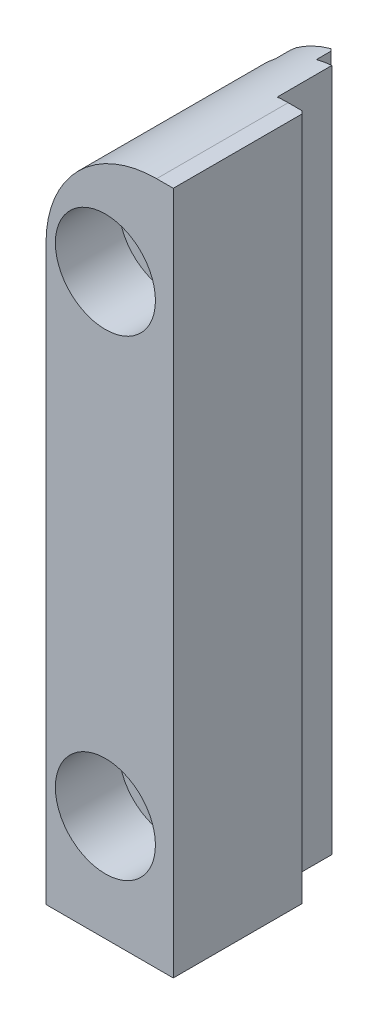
ISO-10303-21;
HEADER;
FILE_DESCRIPTION(('STEP AP214'),'2;1');
FILE_NAME('part.step','',(''),(''),'','','');
FILE_SCHEMA(('AUTOMOTIVE_DESIGN { 1 0 10303 214 1 1 1 1 }'));
ENDSEC;
DATA;
#1=APPLICATION_CONTEXT('core data for automotive mechanical design processes');
#2=APPLICATION_PROTOCOL_DEFINITION('international standard','automotive_design',2000,#1);
#3=PRODUCT_CONTEXT('',#1,'mechanical');
#4=PRODUCT('Part','Part','',(#3));
#5=PRODUCT_RELATED_PRODUCT_CATEGORY('part','',(#4));
#6=PRODUCT_DEFINITION_FORMATION('','',#4);
#7=PRODUCT_DEFINITION_CONTEXT('part definition',#1,'design');
#8=PRODUCT_DEFINITION('design','',#6,#7);
#9=PRODUCT_DEFINITION_SHAPE('','',#8);
#10=(LENGTH_UNIT() NAMED_UNIT(*) SI_UNIT(.MILLI.,.METRE.));
#11=(NAMED_UNIT(*) PLANE_ANGLE_UNIT() SI_UNIT($,.RADIAN.));
#12=(NAMED_UNIT(*) SI_UNIT($,.STERADIAN.) SOLID_ANGLE_UNIT());
#13=UNCERTAINTY_MEASURE_WITH_UNIT(LENGTH_MEASURE(1.E-05),#10,'distance_accuracy_value','');
#14=(GEOMETRIC_REPRESENTATION_CONTEXT(3) GLOBAL_UNCERTAINTY_ASSIGNED_CONTEXT((#13)) GLOBAL_UNIT_ASSIGNED_CONTEXT((#10,
#11,#12)) REPRESENTATION_CONTEXT('',''));
#15=CARTESIAN_POINT('',(0.,0.,0.));
#16=DIRECTION('',(0.,0.,1.));
#17=DIRECTION('',(1.,0.,0.));
#18=AXIS2_PLACEMENT_3D('',#15,#16,#17);
#19=CARTESIAN_POINT('',(-7.32028,29.845,-16.256));
#20=DIRECTION('',(0.,0.,-1.));
#21=DIRECTION('',(1.,0.,0.));
#22=AXIS2_PLACEMENT_3D('',#19,#20,#21);
#23=PLANE('',#22);
#24=CARTESIAN_POINT('',(-5.92328,-20.574,-16.256));
#25=DIRECTION('',(0.,0.,-1.));
#26=DIRECTION('',(-1.,0.,0.));
#27=AXIS2_PLACEMENT_3D('',#24,#25,#26);
#28=CIRCLE('',#27,2.7051);
#29=CARTESIAN_POINT('',(-8.62838,-20.574,-16.256));
#30=VERTEX_POINT('',#29);
#31=EDGE_CURVE('E342',#30,#30,#28,.T.);
#32=ORIENTED_EDGE('',*,*,#31,.F.);
#33=EDGE_LOOP('',(#32));
#34=FACE_BOUND('',#33,.T.);
#35=CARTESIAN_POINT('',(-5.92328,20.574,-16.256));
#36=DIRECTION('',(0.,0.,-1.));
#37=DIRECTION('',(-1.,0.,0.));
#38=AXIS2_PLACEMENT_3D('',#35,#36,#37);
#39=CIRCLE('',#38,2.7051);
#40=CARTESIAN_POINT('',(-8.62838,20.574,-16.256));
#41=VERTEX_POINT('',#40);
#42=EDGE_CURVE('E345',#41,#41,#39,.T.);
#43=ORIENTED_EDGE('',*,*,#42,.F.);
#44=EDGE_LOOP('',(#43));
#45=FACE_BOUND('',#44,.T.);
#46=DIRECTION('',(-0.999999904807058,0.000436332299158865,0.));
#47=VECTOR('',#46,1.);
#48=CARTESIAN_POINT('',(-7.34227917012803,-20.5733808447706,-16.256));
#49=LINE('',#48,#47);
#50=CARTESIAN_POINT('',(-2.74802630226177,-20.5753854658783,-16.256));
#51=VERTEX_POINT('',#50);
#52=CARTESIAN_POINT('',(-2.74828030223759,-20.5753853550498,-16.256));
#53=VERTEX_POINT('',#52);
#54=EDGE_CURVE('E10',#51,#53,#49,.T.);
#55=ORIENTED_EDGE('',*,*,#54,.T.);
#56=CARTESIAN_POINT('',(-5.92328,-20.574,-16.256));
#57=DIRECTION('',(0.,0.,1.));
#58=DIRECTION('',(1.,0.,0.));
#59=AXIS2_PLACEMENT_3D('',#56,#57,#58);
#60=CIRCLE('',#59,3.175);
#61=CARTESIAN_POINT('',(-2.74828,-20.574,-16.256));
#62=VERTEX_POINT('',#61);
#63=EDGE_CURVE('E339',#62,#53,#60,.T.);
#64=ORIENTED_EDGE('',*,*,#63,.F.);
#65=DIRECTION('',(-1.,0.,0.));
#66=VECTOR('',#65,1.);
#67=CARTESIAN_POINT('',(-7.32028,-20.574,-16.256));
#68=LINE('',#67,#66);
#69=CARTESIAN_POINT('',(-2.748026,-20.574,-16.256));
#70=VERTEX_POINT('',#69);
#71=EDGE_CURVE('E24',#62,#70,#68,.F.);
#72=ORIENTED_EDGE('',*,*,#71,.T.);
#73=CARTESIAN_POINT('',(-5.92328,-20.574,-16.256));
#74=DIRECTION('',(0.,0.,-1.));
#75=DIRECTION('',(-1.,0.,0.));
#76=AXIS2_PLACEMENT_3D('',#73,#74,#75);
#77=CIRCLE('',#76,3.175254);
#78=CARTESIAN_POINT('',(-3.76428,-18.2457051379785,-16.256));
#79=VERTEX_POINT('',#78);
#80=EDGE_CURVE('E244',#79,#70,#77,.T.);
#81=ORIENTED_EDGE('',*,*,#80,.F.);
#82=DIRECTION('',(0.,-1.,0.));
#83=VECTOR('',#82,1.);
#84=CARTESIAN_POINT('',(-3.76428,29.845,-16.256));
#85=LINE('',#84,#83);
#86=CARTESIAN_POINT('',(-3.76428,18.2457051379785,-16.256));
#87=VERTEX_POINT('',#86);
#88=EDGE_CURVE('E397',#87,#79,#85,.T.);
#89=ORIENTED_EDGE('',*,*,#88,.F.);
#90=CARTESIAN_POINT('',(-5.92328,20.574,-16.256));
#91=DIRECTION('',(0.,0.,-1.));
#92=DIRECTION('',(-1.,0.,0.));
#93=AXIS2_PLACEMENT_3D('',#90,#91,#92);
#94=CIRCLE('',#93,3.175254);
#95=CARTESIAN_POINT('',(-2.74802630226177,20.5726145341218,-16.256));
#96=VERTEX_POINT('',#95);
#97=EDGE_CURVE('E320',#96,#87,#94,.T.);
#98=ORIENTED_EDGE('',*,*,#97,.F.);
#99=DIRECTION('',(-0.999999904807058,0.000436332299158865,0.));
#100=VECTOR('',#99,1.);
#101=CARTESIAN_POINT('',(-7.32432497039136,20.5746113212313,-16.256));
#102=LINE('',#101,#100);
#103=CARTESIAN_POINT('',(-2.74828030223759,20.5726146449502,-16.256));
#104=VERTEX_POINT('',#103);
#105=EDGE_CURVE('E405',#96,#104,#102,.T.);
#106=ORIENTED_EDGE('',*,*,#105,.T.);
#107=CARTESIAN_POINT('',(-5.92328,20.574,-16.256));
#108=DIRECTION('',(0.,0.,1.));
#109=DIRECTION('',(1.,0.,0.));
#110=AXIS2_PLACEMENT_3D('',#107,#108,#109);
#111=CIRCLE('',#110,3.175);
#112=CARTESIAN_POINT('',(-2.74828,20.574,-16.256));
#113=VERTEX_POINT('',#112);
#114=EDGE_CURVE('E337',#113,#104,#111,.T.);
#115=ORIENTED_EDGE('',*,*,#114,.F.);
#116=DIRECTION('',(-1.,0.,0.));
#117=VECTOR('',#116,1.);
#118=CARTESIAN_POINT('',(-7.32028,20.574,-16.256));
#119=LINE('',#118,#117);
#120=CARTESIAN_POINT('',(-2.748026,20.574,-16.256));
#121=VERTEX_POINT('',#120);
#122=EDGE_CURVE('E402',#113,#121,#119,.F.);
#123=ORIENTED_EDGE('',*,*,#122,.T.);
#124=CARTESIAN_POINT('',(-3.76428,22.9022948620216,-16.256));
#125=VERTEX_POINT('',#124);
#126=EDGE_CURVE('E321',#125,#121,#94,.T.);
#127=ORIENTED_EDGE('',*,*,#126,.F.);
#128=CARTESIAN_POINT('',(-3.76428,29.5641543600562,-16.256));
#129=VERTEX_POINT('',#128);
#130=EDGE_CURVE('E400',#129,#125,#85,.T.);
#131=ORIENTED_EDGE('',*,*,#130,.F.);
#132=CARTESIAN_POINT('',(-1.45288,20.193,-16.256));
#133=DIRECTION('',(0.,0.,1.));
#134=DIRECTION('',(1.,0.,0.));
#135=AXIS2_PLACEMENT_3D('',#132,#133,#134);
#136=CIRCLE('',#135,9.652);
#137=CARTESIAN_POINT('',(-2.413,29.797127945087,-16.256));
#138=VERTEX_POINT('',#137);
#139=EDGE_CURVE('E477',#138,#129,#136,.T.);
#140=ORIENTED_EDGE('',*,*,#139,.F.);
#141=DIRECTION('',(0.,-1.,0.));
#142=VECTOR('',#141,1.);
#143=CARTESIAN_POINT('',(-2.40538,29.845,-16.256));
#144=LINE('',#143,#142);
#145=CARTESIAN_POINT('',(-2.40538,-29.845,-16.256));
#146=VERTEX_POINT('',#145);
#147=EDGE_CURVE('E469',#138,#146,#144,.T.);
#148=ORIENTED_EDGE('',*,*,#147,.T.);
#149=DIRECTION('',(-1.,0.,0.));
#150=VECTOR('',#149,1.);
#151=CARTESIAN_POINT('',(-2.34188,-29.845,-16.256));
#152=LINE('',#151,#150);
#153=CARTESIAN_POINT('',(-3.76428,-29.845,-16.256));
#154=VERTEX_POINT('',#153);
#155=EDGE_CURVE('E357',#146,#154,#152,.T.);
#156=ORIENTED_EDGE('',*,*,#155,.T.);
#157=CARTESIAN_POINT('',(-3.76428,-22.9022948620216,-16.256));
#158=VERTEX_POINT('',#157);
#159=EDGE_CURVE('E401',#158,#154,#85,.T.);
#160=ORIENTED_EDGE('',*,*,#159,.F.);
#161=EDGE_CURVE('E274',#51,#158,#77,.T.);
#162=ORIENTED_EDGE('',*,*,#161,.F.);
#163=EDGE_LOOP('',(#55,#64,#72,#81,#89,#98,#106,#115,#123,#127,#131,#140,#148,#156,#160,#162));
#164=FACE_BOUND('',#163,.T.);
#165=ADVANCED_FACE('F16',(#34,#45,#164),#23,.T.);
#166=CARTESIAN_POINT('',(-5.92328,-20.574,-5.5372));
#167=DIRECTION('',(0.,0.,-1.));
#168=DIRECTION('',(-1.,0.,0.));
#169=AXIS2_PLACEMENT_3D('',#166,#167,#168);
#170=PLANE('',#169);
#171=CARTESIAN_POINT('',(-5.92328,-20.574,-5.5372));
#172=DIRECTION('',(0.,0.,-1.));
#173=DIRECTION('',(-1.,0.,0.));
#174=AXIS2_PLACEMENT_3D('',#171,#172,#173);
#175=CIRCLE('',#174,2.7051);
#176=CARTESIAN_POINT('',(-8.62838,-20.574,-5.5372));
#177=VERTEX_POINT('',#176);
#178=EDGE_CURVE('E516',#177,#177,#175,.F.);
#179=ORIENTED_EDGE('',*,*,#178,.F.);
#180=EDGE_LOOP('',(#179));
#181=FACE_BOUND('',#180,.T.);
#182=CARTESIAN_POINT('',(-5.92328,-20.574,-5.5372));
#183=DIRECTION('',(0.,0.,-1.));
#184=DIRECTION('',(-1.,0.,0.));
#185=AXIS2_PLACEMENT_3D('',#182,#183,#184);
#186=CIRCLE('',#185,4.365625);
#187=CARTESIAN_POINT('',(-10.288905,-20.574,-5.5372));
#188=VERTEX_POINT('',#187);
#189=EDGE_CURVE('E520',#188,#188,#186,.T.);
#190=ORIENTED_EDGE('',*,*,#189,.F.);
#191=EDGE_LOOP('',(#190));
#192=FACE_BOUND('',#191,.T.);
#193=CARTESIAN_POINT('',(-5.92328,-20.574,-5.5372));
#194=DIRECTION('',(0.,0.,1.));
#195=DIRECTION('',(1.,0.,0.));
#196=AXIS2_PLACEMENT_3D('',#193,#194,#195);
#197=CIRCLE('',#196,3.175254);
#198=CARTESIAN_POINT('',(-2.748026,-20.574,-5.5372));
#199=VERTEX_POINT('',#198);
#200=CARTESIAN_POINT('',(-2.74802630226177,-20.5753854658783,-5.5372));
#201=VERTEX_POINT('',#200);
#202=EDGE_CURVE('E241',#199,#201,#197,.T.);
#203=ORIENTED_EDGE('',*,*,#202,.F.);
#204=DIRECTION('',(1.,0.,0.));
#205=VECTOR('',#204,1.);
#206=CARTESIAN_POINT('',(-2.74828,-20.574,-5.5372));
#207=LINE('',#206,#205);
#208=CARTESIAN_POINT('',(-2.74828,-20.574,-5.5372));
#209=VERTEX_POINT('',#208);
#210=EDGE_CURVE('E249',#199,#209,#207,.F.);
#211=ORIENTED_EDGE('',*,*,#210,.T.);
#212=CARTESIAN_POINT('',(-5.92328,-20.574,-5.5372));
#213=DIRECTION('',(0.,0.,1.));
#214=DIRECTION('',(1.,0.,0.));
#215=AXIS2_PLACEMENT_3D('',#212,#213,#214);
#216=CIRCLE('',#215,3.175);
#217=CARTESIAN_POINT('',(-2.74828030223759,-20.5753853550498,-5.5372));
#218=VERTEX_POINT('',#217);
#219=EDGE_CURVE('E264',#209,#218,#216,.T.);
#220=ORIENTED_EDGE('',*,*,#219,.T.);
#221=DIRECTION('',(0.999999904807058,-0.000436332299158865,0.));
#222=VECTOR('',#221,1.);
#223=CARTESIAN_POINT('',(-2.74828030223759,-20.5753853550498,-5.5372));
#224=LINE('',#223,#222);
#225=EDGE_CURVE('E254',#201,#218,#224,.F.);
#226=ORIENTED_EDGE('',*,*,#225,.F.);
#227=EDGE_LOOP('',(#203,#211,#220,#226));
#228=FACE_BOUND('',#227,.T.);
#229=ADVANCED_FACE('F257',(#181,#192,#228),#170,.F.);
#230=CARTESIAN_POINT('',(-7.32028,-23.4254257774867,-16.256));
#231=VERTEX_POINT('',#230);
#232=CARTESIAN_POINT('',(-7.32028,-17.7225742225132,-16.256));
#233=VERTEX_POINT('',#232);
#234=EDGE_CURVE('E277',#231,#233,#77,.T.);
#235=ORIENTED_EDGE('',*,*,#234,.F.);
#236=DIRECTION('',(0.,-1.,0.));
#237=VECTOR('',#236,1.);
#238=CARTESIAN_POINT('',(-7.32028,29.845,-16.256));
#239=LINE('',#238,#237);
#240=CARTESIAN_POINT('',(-7.32028,-29.845,-16.256));
#241=VERTEX_POINT('',#240);
#242=EDGE_CURVE('E395',#231,#241,#239,.T.);
#243=ORIENTED_EDGE('',*,*,#242,.T.);
#244=DIRECTION('',(-1.,0.,0.));
#245=VECTOR('',#244,1.);
#246=CARTESIAN_POINT('',(-7.32028,-29.845,-16.256));
#247=LINE('',#246,#245);
#248=CARTESIAN_POINT('',(-11.10488,-29.845,-16.256));
#249=VERTEX_POINT('',#248);
#250=EDGE_CURVE('E369',#241,#249,#247,.T.);
#251=ORIENTED_EDGE('',*,*,#250,.T.);
#252=DIRECTION('',(0.,-1.,0.));
#253=VECTOR('',#252,1.);
#254=CARTESIAN_POINT('',(-11.10488,29.845,-16.256));
#255=LINE('',#254,#253);
#256=CARTESIAN_POINT('',(-11.10488,20.193,-16.256));
#257=VERTEX_POINT('',#256);
#258=EDGE_CURVE('E378',#257,#249,#255,.T.);
#259=ORIENTED_EDGE('',*,*,#258,.F.);
#260=CARTESIAN_POINT('',(-1.45288,20.193,-16.256));
#261=DIRECTION('',(0.,0.,1.));
#262=DIRECTION('',(1.,0.,0.));
#263=AXIS2_PLACEMENT_3D('',#260,#261,#262);
#264=CIRCLE('',#263,9.652);
#265=CARTESIAN_POINT('',(-7.32028,27.8568581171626,-16.256));
#266=VERTEX_POINT('',#265);
#267=EDGE_CURVE('E585',#266,#257,#264,.T.);
#268=ORIENTED_EDGE('',*,*,#267,.F.);
#269=CARTESIAN_POINT('',(-7.32028,23.4254257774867,-16.256));
#270=VERTEX_POINT('',#269);
#271=EDGE_CURVE('E386',#266,#270,#239,.T.);
#272=ORIENTED_EDGE('',*,*,#271,.T.);
#273=CARTESIAN_POINT('',(-7.32028,17.7225742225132,-16.256));
#274=VERTEX_POINT('',#273);
#275=EDGE_CURVE('E317',#274,#270,#94,.T.);
#276=ORIENTED_EDGE('',*,*,#275,.F.);
#277=EDGE_CURVE('E391',#274,#233,#239,.T.);
#278=ORIENTED_EDGE('',*,*,#277,.T.);
#279=EDGE_LOOP('',(#235,#243,#251,#259,#268,#272,#276,#278));
#280=FACE_BOUND('',#279,.T.);
#281=ADVANCED_FACE('F549',(#280),#23,.T.);
#282=CARTESIAN_POINT('',(-5.92328,20.574,-5.5372));
#283=DIRECTION('',(0.,0.,-1.));
#284=DIRECTION('',(-1.,0.,0.));
#285=AXIS2_PLACEMENT_3D('',#282,#283,#284);
#286=PLANE('',#285);
#287=CARTESIAN_POINT('',(-5.92328,20.574,-5.5372));
#288=DIRECTION('',(0.,0.,-1.));
#289=DIRECTION('',(-1.,0.,0.));
#290=AXIS2_PLACEMENT_3D('',#287,#288,#289);
#291=CIRCLE('',#290,2.7051);
#292=CARTESIAN_POINT('',(-8.62838,20.574,-5.5372));
#293=VERTEX_POINT('',#292);
#294=EDGE_CURVE('E346',#293,#293,#291,.F.);
#295=ORIENTED_EDGE('',*,*,#294,.F.);
#296=EDGE_LOOP('',(#295));
#297=FACE_BOUND('',#296,.T.);
#298=CARTESIAN_POINT('',(-5.92328,20.574,-5.5372));
#299=DIRECTION('',(0.,0.,-1.));
#300=DIRECTION('',(-1.,0.,0.));
#301=AXIS2_PLACEMENT_3D('',#298,#299,#300);
#302=CIRCLE('',#301,4.365625);
#303=CARTESIAN_POINT('',(-10.288905,20.574,-5.5372));
#304=VERTEX_POINT('',#303);
#305=EDGE_CURVE('E515',#304,#304,#302,.T.);
#306=ORIENTED_EDGE('',*,*,#305,.F.);
#307=EDGE_LOOP('',(#306));
#308=FACE_BOUND('',#307,.T.);
#309=CARTESIAN_POINT('',(-5.92328,20.574,-5.5372));
#310=DIRECTION('',(0.,0.,1.));
#311=DIRECTION('',(1.,0.,0.));
#312=AXIS2_PLACEMENT_3D('',#309,#310,#311);
#313=CIRCLE('',#312,3.175254);
#314=CARTESIAN_POINT('',(-2.748026,20.574,-5.5372));
#315=VERTEX_POINT('',#314);
#316=CARTESIAN_POINT('',(-2.74802630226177,20.5726145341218,-5.5372));
#317=VERTEX_POINT('',#316);
#318=EDGE_CURVE('E292',#315,#317,#313,.T.);
#319=ORIENTED_EDGE('',*,*,#318,.F.);
#320=DIRECTION('',(1.,0.,0.));
#321=VECTOR('',#320,1.);
#322=CARTESIAN_POINT('',(-2.74828,20.574,-5.5372));
#323=LINE('',#322,#321);
#324=CARTESIAN_POINT('',(-2.74828,20.574,-5.5372));
#325=VERTEX_POINT('',#324);
#326=EDGE_CURVE('E307',#315,#325,#323,.F.);
#327=ORIENTED_EDGE('',*,*,#326,.T.);
#328=CARTESIAN_POINT('',(-5.92328,20.574,-5.5372));
#329=DIRECTION('',(0.,0.,1.));
#330=DIRECTION('',(1.,0.,0.));
#331=AXIS2_PLACEMENT_3D('',#328,#329,#330);
#332=CIRCLE('',#331,3.175);
#333=CARTESIAN_POINT('',(-2.74828030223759,20.5726146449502,-5.5372));
#334=VERTEX_POINT('',#333);
#335=EDGE_CURVE('E300',#325,#334,#332,.T.);
#336=ORIENTED_EDGE('',*,*,#335,.T.);
#337=DIRECTION('',(0.999999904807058,-0.000436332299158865,0.));
#338=VECTOR('',#337,1.);
#339=CARTESIAN_POINT('',(-2.74828030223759,20.5726146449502,-5.5372));
#340=LINE('',#339,#338);
#341=EDGE_CURVE('E304',#317,#334,#340,.F.);
#342=ORIENTED_EDGE('',*,*,#341,.F.);
#343=EDGE_LOOP('',(#319,#327,#336,#342));
#344=FACE_BOUND('',#343,.T.);
#345=ADVANCED_FACE('F560',(#297,#308,#344),#286,.F.);
#346=CARTESIAN_POINT('',(-3.76428,29.845,-16.256));
#347=DIRECTION('',(1.,0.,0.));
#348=DIRECTION('',(0.,0.,1.));
#349=AXIS2_PLACEMENT_3D('',#346,#347,#348);
#350=PLANE('',#349);
#351=DIRECTION('',(0.,0.,1.));
#352=VECTOR('',#351,1.);
#353=CARTESIAN_POINT('',(-3.76428,-22.9022948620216,-5.5372));
#354=LINE('',#353,#352);
#355=CARTESIAN_POINT('',(-3.76428,-22.9022948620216,-17.526));
#356=VERTEX_POINT('',#355);
#357=EDGE_CURVE('E31',#158,#356,#354,.F.);
#358=ORIENTED_EDGE('',*,*,#357,.F.);
#359=ORIENTED_EDGE('',*,*,#159,.T.);
#360=DIRECTION('',(0.,0.,-1.));
#361=VECTOR('',#360,1.);
#362=CARTESIAN_POINT('',(-3.76428,-29.845,-16.256));
#363=LINE('',#362,#361);
#364=CARTESIAN_POINT('',(-3.76428,-29.845,-17.526));
#365=VERTEX_POINT('',#364);
#366=EDGE_CURVE('E360',#154,#365,#363,.T.);
#367=ORIENTED_EDGE('',*,*,#366,.T.);
#368=DIRECTION('',(0.,1.,0.));
#369=VECTOR('',#368,1.);
#370=CARTESIAN_POINT('',(-3.76428,29.845,-17.526));
#371=LINE('',#370,#369);
#372=EDGE_CURVE('E423',#365,#356,#371,.T.);
#373=ORIENTED_EDGE('',*,*,#372,.T.);
#374=EDGE_LOOP('',(#358,#359,#367,#373));
#375=FACE_BOUND('',#374,.T.);
#376=ADVANCED_FACE('F420',(#375),#350,.T.);
#377=CARTESIAN_POINT('',(-7.32028,29.845,-17.526));
#378=DIRECTION('',(0.707106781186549,0.,0.707106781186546));
#379=DIRECTION('',(0.707106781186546,0.,-0.707106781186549));
#380=AXIS2_PLACEMENT_3D('',#377,#378,#379);
#381=PLANE('',#380);
#382=CARTESIAN_POINT('',(-5.92328,-20.574,-18.923));
#383=DIRECTION('',(0.707106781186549,0.,0.707106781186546));
#384=DIRECTION('',(-0.707106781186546,0.,0.707106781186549));
#385=AXIS2_PLACEMENT_3D('',#382,#383,#384);
#386=ELLIPSE('',#385,4.49048727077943,3.175254);
#387=CARTESIAN_POINT('',(-7.06628,-23.5363958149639,-17.78));
#388=VERTEX_POINT('',#387);
#389=CARTESIAN_POINT('',(-7.32028,-23.4254257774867,-17.526));
#390=VERTEX_POINT('',#389);
#391=EDGE_CURVE('E271',#388,#390,#386,.F.);
#392=ORIENTED_EDGE('',*,*,#391,.F.);
#393=DIRECTION('',(0.,1.,0.));
#394=VECTOR('',#393,1.);
#395=CARTESIAN_POINT('',(-7.06628,29.845,-17.78));
#396=LINE('',#395,#394);
#397=CARTESIAN_POINT('',(-7.06628,-29.845,-17.78));
#398=VERTEX_POINT('',#397);
#399=EDGE_CURVE('E444',#398,#388,#396,.T.);
#400=ORIENTED_EDGE('',*,*,#399,.F.);
#401=DIRECTION('',(-0.707106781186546,0.,0.707106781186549));
#402=VECTOR('',#401,1.);
#403=CARTESIAN_POINT('',(-7.32028,-29.845,-17.526));
#404=LINE('',#403,#402);
#405=CARTESIAN_POINT('',(-7.32028,-29.845,-17.526));
#406=VERTEX_POINT('',#405);
#407=EDGE_CURVE('E456',#406,#398,#404,.F.);
#408=ORIENTED_EDGE('',*,*,#407,.F.);
#409=DIRECTION('',(0.,-1.,0.));
#410=VECTOR('',#409,1.);
#411=CARTESIAN_POINT('',(-7.32028,29.845,-17.526));
#412=LINE('',#411,#410);
#413=EDGE_CURVE('E466',#390,#406,#412,.T.);
#414=ORIENTED_EDGE('',*,*,#413,.F.);
#415=EDGE_LOOP('',(#392,#400,#408,#414));
#416=FACE_BOUND('',#415,.T.);
#417=ADVANCED_FACE('F675',(#416),#381,.F.);
#418=CARTESIAN_POINT('',(-3.76428,29.845,-17.78));
#419=DIRECTION('',(0.,0.,-1.));
#420=DIRECTION('',(1.,0.,0.));
#421=AXIS2_PLACEMENT_3D('',#418,#419,#420);
#422=PLANE('',#421);
#423=CARTESIAN_POINT('',(-5.92328,-20.574,-17.78));
#424=DIRECTION('',(0.,0.,-1.));
#425=DIRECTION('',(-1.,0.,0.));
#426=AXIS2_PLACEMENT_3D('',#423,#424,#425);
#427=CIRCLE('',#426,3.175254);
#428=CARTESIAN_POINT('',(-7.06628,-17.6116041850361,-17.78));
#429=VERTEX_POINT('',#428);
#430=CARTESIAN_POINT('',(-4.01828,-18.0336825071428,-17.78));
#431=VERTEX_POINT('',#430);
#432=EDGE_CURVE('E283',#429,#431,#427,.T.);
#433=ORIENTED_EDGE('',*,*,#432,.F.);
#434=CARTESIAN_POINT('',(-7.06628,17.6116041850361,-17.78));
#435=VERTEX_POINT('',#434);
#436=EDGE_CURVE('E449',#429,#435,#396,.T.);
#437=ORIENTED_EDGE('',*,*,#436,.T.);
#438=CARTESIAN_POINT('',(-5.92328,20.574,-17.78));
#439=DIRECTION('',(0.,0.,-1.));
#440=DIRECTION('',(-1.,0.,0.));
#441=AXIS2_PLACEMENT_3D('',#438,#439,#440);
#442=CIRCLE('',#441,3.175254);
#443=CARTESIAN_POINT('',(-4.01828,18.0336825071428,-17.78));
#444=VERTEX_POINT('',#443);
#445=EDGE_CURVE('E329',#444,#435,#442,.T.);
#446=ORIENTED_EDGE('',*,*,#445,.F.);
#447=DIRECTION('',(0.,-1.,0.));
#448=VECTOR('',#447,1.);
#449=CARTESIAN_POINT('',(-4.01828,29.845,-17.78));
#450=LINE('',#449,#448);
#451=EDGE_CURVE('E454',#444,#431,#450,.T.);
#452=ORIENTED_EDGE('',*,*,#451,.T.);
#453=EDGE_LOOP('',(#433,#437,#446,#452));
#454=FACE_BOUND('',#453,.T.);
#455=ADVANCED_FACE('F628',(#454),#422,.T.);
#456=CARTESIAN_POINT('',(-7.32028,29.845,-17.78));
#457=DIRECTION('',(-1.,0.,0.));
#458=DIRECTION('',(0.,0.,-1.));
#459=AXIS2_PLACEMENT_3D('',#456,#457,#458);
#460=PLANE('',#459);
#461=DIRECTION('',(0.,0.,1.));
#462=VECTOR('',#461,1.);
#463=CARTESIAN_POINT('',(-7.32028,-17.7225742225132,-5.5372));
#464=LINE('',#463,#462);
#465=CARTESIAN_POINT('',(-7.32028,-17.7225742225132,-17.526));
#466=VERTEX_POINT('',#465);
#467=EDGE_CURVE('E279',#233,#466,#464,.F.);
#468=ORIENTED_EDGE('',*,*,#467,.F.);
#469=ORIENTED_EDGE('',*,*,#277,.F.);
#470=DIRECTION('',(0.,0.,1.));
#471=VECTOR('',#470,1.);
#472=CARTESIAN_POINT('',(-7.32028,17.7225742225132,-5.5372));
#473=LINE('',#472,#471);
#474=CARTESIAN_POINT('',(-7.32028,17.7225742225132,-17.526));
#475=VERTEX_POINT('',#474);
#476=EDGE_CURVE('E323',#475,#274,#473,.T.);
#477=ORIENTED_EDGE('',*,*,#476,.F.);
#478=EDGE_CURVE('E465',#475,#466,#412,.T.);
#479=ORIENTED_EDGE('',*,*,#478,.T.);
#480=EDGE_LOOP('',(#468,#469,#477,#479));
#481=FACE_BOUND('',#480,.T.);
#482=ADVANCED_FACE('F669',(#481),#460,.T.);
#483=CARTESIAN_POINT('',(-4.01828,29.845,-17.78));
#484=DIRECTION('',(-0.707106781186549,0.,0.707106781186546));
#485=DIRECTION('',(0.707106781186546,0.,0.707106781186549));
#486=AXIS2_PLACEMENT_3D('',#483,#484,#485);
#487=PLANE('',#486);
#488=CARTESIAN_POINT('',(-5.92328,-20.574,-19.685));
#489=DIRECTION('',(-0.707106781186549,0.,0.707106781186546));
#490=DIRECTION('',(0.707106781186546,0.,0.707106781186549));
#491=AXIS2_PLACEMENT_3D('',#488,#489,#490);
#492=ELLIPSE('',#491,4.49048727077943,3.175254);
#493=CARTESIAN_POINT('',(-3.76428,-18.2457051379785,-17.526));
#494=VERTEX_POINT('',#493);
#495=EDGE_CURVE('E285',#431,#494,#492,.F.);
#496=ORIENTED_EDGE('',*,*,#495,.F.);
#497=ORIENTED_EDGE('',*,*,#451,.F.);
#498=CARTESIAN_POINT('',(-5.92328,20.574,-19.685));
#499=DIRECTION('',(-0.707106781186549,0.,0.707106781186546));
#500=DIRECTION('',(0.707106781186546,0.,0.707106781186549));
#501=AXIS2_PLACEMENT_3D('',#498,#499,#500);
#502=ELLIPSE('',#501,4.49048727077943,3.175254);
#503=CARTESIAN_POINT('',(-3.76428,18.2457051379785,-17.526));
#504=VERTEX_POINT('',#503);
#505=EDGE_CURVE('E332',#504,#444,#502,.F.);
#506=ORIENTED_EDGE('',*,*,#505,.F.);
#507=EDGE_CURVE('E427',#494,#504,#371,.T.);
#508=ORIENTED_EDGE('',*,*,#507,.F.);
#509=EDGE_LOOP('',(#496,#497,#506,#508));
#510=FACE_BOUND('',#509,.T.);
#511=ADVANCED_FACE('F621',(#510),#487,.F.);
#512=DIRECTION('',(0.,0.,1.));
#513=VECTOR('',#512,1.);
#514=CARTESIAN_POINT('',(-3.76428,-18.2457051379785,-5.5372));
#515=LINE('',#514,#513);
#516=EDGE_CURVE('E287',#494,#79,#515,.T.);
#517=ORIENTED_EDGE('',*,*,#516,.F.);
#518=ORIENTED_EDGE('',*,*,#507,.T.);
#519=DIRECTION('',(0.,0.,1.));
#520=VECTOR('',#519,1.);
#521=CARTESIAN_POINT('',(-3.76428,18.2457051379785,-5.5372));
#522=LINE('',#521,#520);
#523=EDGE_CURVE('E334',#87,#504,#522,.F.);
#524=ORIENTED_EDGE('',*,*,#523,.F.);
#525=ORIENTED_EDGE('',*,*,#88,.T.);
#526=EDGE_LOOP('',(#517,#518,#524,#525));
#527=FACE_BOUND('',#526,.T.);
#528=ADVANCED_FACE('F617',(#527),#350,.T.);
#529=CARTESIAN_POINT('',(-5.92328,20.574,-17.78));
#530=DIRECTION('',(0.,0.,-1.));
#531=DIRECTION('',(-1.,0.,0.));
#532=AXIS2_PLACEMENT_3D('',#529,#530,#531);
#533=CIRCLE('',#532,3.175254);
#534=CARTESIAN_POINT('',(-7.06628,23.5363958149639,-17.78));
#535=VERTEX_POINT('',#534);
#536=CARTESIAN_POINT('',(-4.01828,23.1143174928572,-17.78));
#537=VERTEX_POINT('',#536);
#538=EDGE_CURVE('E315',#535,#537,#533,.T.);
#539=ORIENTED_EDGE('',*,*,#538,.F.);
#540=CARTESIAN_POINT('',(-7.06628,28.0448051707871,-17.78));
#541=VERTEX_POINT('',#540);
#542=EDGE_CURVE('E450',#535,#541,#396,.T.);
#543=ORIENTED_EDGE('',*,*,#542,.T.);
#544=CARTESIAN_POINT('',(-1.45288,20.193,-17.78));
#545=DIRECTION('',(0.,0.,1.));
#546=DIRECTION('',(1.,0.,0.));
#547=AXIS2_PLACEMENT_3D('',#544,#545,#546);
#548=CIRCLE('',#547,9.652);
#549=CARTESIAN_POINT('',(-4.01828,29.4978281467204,-17.78));
#550=VERTEX_POINT('',#549);
#551=EDGE_CURVE('E637',#550,#541,#548,.T.);
#552=ORIENTED_EDGE('',*,*,#551,.F.);
#553=EDGE_CURVE('E451',#550,#537,#450,.T.);
#554=ORIENTED_EDGE('',*,*,#553,.T.);
#555=EDGE_LOOP('',(#539,#543,#552,#554));
#556=FACE_BOUND('',#555,.T.);
#557=ADVANCED_FACE('F636',(#556),#422,.T.);
#558=DIRECTION('',(0.,0.,1.));
#559=VECTOR('',#558,1.);
#560=CARTESIAN_POINT('',(-7.32028,23.4254257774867,-5.5372));
#561=LINE('',#560,#559);
#562=CARTESIAN_POINT('',(-7.32028,23.4254257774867,-17.526));
#563=VERTEX_POINT('',#562);
#564=EDGE_CURVE('E313',#270,#563,#561,.F.);
#565=ORIENTED_EDGE('',*,*,#564,.F.);
#566=ORIENTED_EDGE('',*,*,#271,.F.);
#567=DIRECTION('',(0.,0.,1.));
#568=VECTOR('',#567,1.);
#569=CARTESIAN_POINT('',(-7.32028,27.8568581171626,-17.78));
#570=LINE('',#569,#568);
#571=CARTESIAN_POINT('',(-7.32028,27.8568581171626,-17.526));
#572=VERTEX_POINT('',#571);
#573=EDGE_CURVE('E595',#572,#266,#570,.T.);
#574=ORIENTED_EDGE('',*,*,#573,.F.);
#575=EDGE_CURVE('E462',#572,#563,#412,.T.);
#576=ORIENTED_EDGE('',*,*,#575,.T.);
#577=EDGE_LOOP('',(#565,#566,#574,#576));
#578=FACE_BOUND('',#577,.T.);
#579=ADVANCED_FACE('F647',(#578),#460,.T.);
#580=CARTESIAN_POINT('',(-5.92328,-20.574,-18.923));
#581=DIRECTION('',(0.707106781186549,0.,0.707106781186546));
#582=DIRECTION('',(-0.707106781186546,0.,0.707106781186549));
#583=AXIS2_PLACEMENT_3D('',#580,#581,#582);
#584=ELLIPSE('',#583,4.49048727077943,3.175254);
#585=EDGE_CURVE('E281',#466,#429,#584,.F.);
#586=ORIENTED_EDGE('',*,*,#585,.F.);
#587=ORIENTED_EDGE('',*,*,#478,.F.);
#588=CARTESIAN_POINT('',(-5.92328,20.574,-18.923));
#589=DIRECTION('',(0.707106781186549,0.,0.707106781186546));
#590=DIRECTION('',(-0.707106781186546,0.,0.707106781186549));
#591=AXIS2_PLACEMENT_3D('',#588,#589,#590);
#592=ELLIPSE('',#591,4.49048727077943,3.175254);
#593=EDGE_CURVE('E327',#435,#475,#592,.F.);
#594=ORIENTED_EDGE('',*,*,#593,.F.);
#595=ORIENTED_EDGE('',*,*,#436,.F.);
#596=EDGE_LOOP('',(#586,#587,#594,#595));
#597=FACE_BOUND('',#596,.T.);
#598=ADVANCED_FACE('F672',(#597),#381,.F.);
#599=CARTESIAN_POINT('',(-5.92328,20.574,-19.685));
#600=DIRECTION('',(-0.707106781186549,0.,0.707106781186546));
#601=DIRECTION('',(0.707106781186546,0.,0.707106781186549));
#602=AXIS2_PLACEMENT_3D('',#599,#600,#601);
#603=ELLIPSE('',#602,4.49048727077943,3.175254);
#604=CARTESIAN_POINT('',(-3.76428,22.9022948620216,-17.526));
#605=VERTEX_POINT('',#604);
#606=EDGE_CURVE('E319',#537,#605,#603,.F.);
#607=ORIENTED_EDGE('',*,*,#606,.F.);
#608=ORIENTED_EDGE('',*,*,#553,.F.);
#609=CARTESIAN_POINT('',(-1.45288,20.193,-15.2146));
#610=DIRECTION('',(-0.707106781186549,0.,0.707106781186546));
#611=DIRECTION('',(0.707106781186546,0.,0.707106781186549));
#612=AXIS2_PLACEMENT_3D('',#609,#610,#611);
#613=ELLIPSE('',#612,13.6499893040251,9.652);
#614=CARTESIAN_POINT('',(-3.76428,29.5641543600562,-17.526));
#615=VERTEX_POINT('',#614);
#616=EDGE_CURVE('E439',#615,#550,#613,.T.);
#617=ORIENTED_EDGE('',*,*,#616,.F.);
#618=EDGE_CURVE('E429',#605,#615,#371,.T.);
#619=ORIENTED_EDGE('',*,*,#618,.F.);
#620=EDGE_LOOP('',(#607,#608,#617,#619));
#621=FACE_BOUND('',#620,.T.);
#622=ADVANCED_FACE('F666',(#621),#487,.F.);
#623=CARTESIAN_POINT('',(-11.10488,29.845,-16.256));
#624=DIRECTION('',(-1.,0.,0.));
#625=DIRECTION('',(0.,0.,-1.));
#626=AXIS2_PLACEMENT_3D('',#623,#624,#625);
#627=PLANE('',#626);
#628=ORIENTED_EDGE('',*,*,#258,.T.);
#629=DIRECTION('',(0.,0.,1.));
#630=VECTOR('',#629,1.);
#631=CARTESIAN_POINT('',(-11.10488,-29.845,-16.256));
#632=LINE('',#631,#630);
#633=CARTESIAN_POINT('',(-11.10488,-29.845,0.));
#634=VERTEX_POINT('',#633);
#635=EDGE_CURVE('E349',#249,#634,#632,.T.);
#636=ORIENTED_EDGE('',*,*,#635,.T.);
#637=DIRECTION('',(0.,-1.,0.));
#638=VECTOR('',#637,1.);
#639=CARTESIAN_POINT('',(-11.10488,29.845,0.));
#640=LINE('',#639,#638);
#641=CARTESIAN_POINT('',(-11.10488,20.193,0.));
#642=VERTEX_POINT('',#641);
#643=EDGE_CURVE('E499',#642,#634,#640,.T.);
#644=ORIENTED_EDGE('',*,*,#643,.F.);
#645=DIRECTION('',(0.,0.,1.));
#646=VECTOR('',#645,1.);
#647=CARTESIAN_POINT('',(-11.10488,20.193,-16.256));
#648=LINE('',#647,#646);
#649=EDGE_CURVE('E593',#257,#642,#648,.T.);
#650=ORIENTED_EDGE('',*,*,#649,.F.);
#651=EDGE_LOOP('',(#628,#636,#644,#650));
#652=FACE_BOUND('',#651,.T.);
#653=ADVANCED_FACE('F597',(#652),#627,.T.);
#654=CARTESIAN_POINT('',(-11.07948,29.845,0.));
#655=DIRECTION('',(0.,0.,1.));
#656=DIRECTION('',(-1.,0.,0.));
#657=AXIS2_PLACEMENT_3D('',#654,#655,#656);
#658=PLANE('',#657);
#659=CARTESIAN_POINT('',(-5.92328,-20.574,0.));
#660=DIRECTION('',(0.,0.,1.));
#661=DIRECTION('',(1.,0.,0.));
#662=AXIS2_PLACEMENT_3D('',#659,#660,#661);
#663=CIRCLE('',#662,4.365625);
#664=CARTESIAN_POINT('',(-1.557655,-20.574,0.));
#665=VERTEX_POINT('',#664);
#666=EDGE_CURVE('E341',#665,#665,#663,.F.);
#667=ORIENTED_EDGE('',*,*,#666,.T.);
#668=EDGE_LOOP('',(#667));
#669=FACE_BOUND('',#668,.T.);
#670=CARTESIAN_POINT('',(-5.92328,20.574,0.));
#671=DIRECTION('',(0.,0.,1.));
#672=DIRECTION('',(1.,0.,0.));
#673=AXIS2_PLACEMENT_3D('',#670,#671,#672);
#674=CIRCLE('',#673,4.365625);
#675=CARTESIAN_POINT('',(-1.557655,20.574,0.));
#676=VERTEX_POINT('',#675);
#677=EDGE_CURVE('E519',#676,#676,#674,.F.);
#678=ORIENTED_EDGE('',*,*,#677,.T.);
#679=EDGE_LOOP('',(#678));
#680=FACE_BOUND('',#679,.T.);
#681=ORIENTED_EDGE('',*,*,#643,.T.);
#682=DIRECTION('',(1.,0.,0.));
#683=VECTOR('',#682,1.);
#684=CARTESIAN_POINT('',(-11.07948,-29.845,0.));
#685=LINE('',#684,#683);
#686=CARTESIAN_POINT('',(0.,-29.845,0.));
#687=VERTEX_POINT('',#686);
#688=EDGE_CURVE('E350',#634,#687,#685,.T.);
#689=ORIENTED_EDGE('',*,*,#688,.T.);
#690=DIRECTION('',(0.,-1.,0.));
#691=VECTOR('',#690,1.);
#692=CARTESIAN_POINT('',(0.,29.845,0.));
#693=LINE('',#692,#691);
#694=CARTESIAN_POINT('',(0.,29.845,0.));
#695=VERTEX_POINT('',#694);
#696=EDGE_CURVE('E483',#695,#687,#693,.T.);
#697=ORIENTED_EDGE('',*,*,#696,.F.);
#698=DIRECTION('',(1.,0.,0.));
#699=VECTOR('',#698,1.);
#700=CARTESIAN_POINT('',(-11.07948,29.845,0.));
#701=LINE('',#700,#699);
#702=CARTESIAN_POINT('',(-1.45288,29.845,0.));
#703=VERTEX_POINT('',#702);
#704=EDGE_CURVE('E372',#703,#695,#701,.T.);
#705=ORIENTED_EDGE('',*,*,#704,.F.);
#706=CARTESIAN_POINT('',(-1.45288,20.193,0.));
#707=DIRECTION('',(0.,0.,-1.));
#708=DIRECTION('',(-1.,0.,0.));
#709=AXIS2_PLACEMENT_3D('',#706,#707,#708);
#710=CIRCLE('',#709,9.652);
#711=EDGE_CURVE('E599',#642,#703,#710,.T.);
#712=ORIENTED_EDGE('',*,*,#711,.F.);
#713=EDGE_LOOP('',(#681,#689,#697,#705,#712));
#714=FACE_BOUND('',#713,.T.);
#715=ADVANCED_FACE('F530',(#669,#680,#714),#658,.T.);
#716=CARTESIAN_POINT('',(0.,29.845,0.));
#717=DIRECTION('',(1.,0.,0.));
#718=DIRECTION('',(0.,0.,1.));
#719=AXIS2_PLACEMENT_3D('',#716,#717,#718);
#720=PLANE('',#719);
#721=DIRECTION('',(0.,0.,-1.));
#722=VECTOR('',#721,1.);
#723=CARTESIAN_POINT('',(0.,-29.845,-11.4808));
#724=LINE('',#723,#722);
#725=CARTESIAN_POINT('',(0.,-29.845,-11.2268));
#726=VERTEX_POINT('',#725);
#727=EDGE_CURVE('E353',#687,#726,#724,.T.);
#728=ORIENTED_EDGE('',*,*,#727,.T.);
#729=DIRECTION('',(0.,1.,0.));
#730=VECTOR('',#729,1.);
#731=CARTESIAN_POINT('',(0.,29.845,-11.2268));
#732=LINE('',#731,#730);
#733=CARTESIAN_POINT('',(0.,29.845,-11.2268));
#734=VERTEX_POINT('',#733);
#735=EDGE_CURVE('E431',#726,#734,#732,.T.);
#736=ORIENTED_EDGE('',*,*,#735,.T.);
#737=DIRECTION('',(0.,0.,-1.));
#738=VECTOR('',#737,1.);
#739=CARTESIAN_POINT('',(0.,29.845,-11.4808));
#740=LINE('',#739,#738);
#741=EDGE_CURVE('E375',#695,#734,#740,.T.);
#742=ORIENTED_EDGE('',*,*,#741,.F.);
#743=ORIENTED_EDGE('',*,*,#696,.T.);
#744=EDGE_LOOP('',(#728,#736,#742,#743));
#745=FACE_BOUND('',#744,.T.);
#746=ADVANCED_FACE('F503',(#745),#720,.T.);
#747=CARTESIAN_POINT('',(0.00380999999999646,29.845,-11.4808));
#748=DIRECTION('',(0.,0.,-1.));
#749=DIRECTION('',(1.,0.,0.));
#750=AXIS2_PLACEMENT_3D('',#747,#748,#749);
#751=PLANE('',#750);
#752=DIRECTION('',(-1.,0.,0.));
#753=VECTOR('',#752,1.);
#754=CARTESIAN_POINT('',(0.00380999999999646,29.845,-11.4808));
#755=LINE('',#754,#753);
#756=CARTESIAN_POINT('',(-0.254000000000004,29.845,-11.4808));
#757=VERTEX_POINT('',#756);
#758=CARTESIAN_POINT('',(-1.45288,29.845,-11.4808));
#759=VERTEX_POINT('',#758);
#760=EDGE_CURVE('E376',#757,#759,#755,.T.);
#761=ORIENTED_EDGE('',*,*,#760,.F.);
#762=DIRECTION('',(0.,-1.,0.));
#763=VECTOR('',#762,1.);
#764=CARTESIAN_POINT('',(-0.254000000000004,29.845,-11.4808));
#765=LINE('',#764,#763);
#766=CARTESIAN_POINT('',(-0.254000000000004,-29.845,-11.4808));
#767=VERTEX_POINT('',#766);
#768=EDGE_CURVE('E426',#757,#767,#765,.T.);
#769=ORIENTED_EDGE('',*,*,#768,.T.);
#770=DIRECTION('',(-1.,0.,0.));
#771=VECTOR('',#770,1.);
#772=CARTESIAN_POINT('',(0.00380999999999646,-29.845,-11.4808));
#773=LINE('',#772,#771);
#774=CARTESIAN_POINT('',(-2.40538,-29.845,-11.4808));
#775=VERTEX_POINT('',#774);
#776=EDGE_CURVE('E354',#767,#775,#773,.T.);
#777=ORIENTED_EDGE('',*,*,#776,.T.);
#778=DIRECTION('',(0.,-1.,0.));
#779=VECTOR('',#778,1.);
#780=CARTESIAN_POINT('',(-2.40538,29.845,-11.4808));
#781=LINE('',#780,#779);
#782=CARTESIAN_POINT('',(-2.40538,29.797127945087,-11.4808));
#783=VERTEX_POINT('',#782);
#784=EDGE_CURVE('E471',#783,#775,#781,.T.);
#785=ORIENTED_EDGE('',*,*,#784,.F.);
#786=CARTESIAN_POINT('',(-1.45288,20.193,-11.4808));
#787=DIRECTION('',(0.,0.,1.));
#788=DIRECTION('',(1.,0.,0.));
#789=AXIS2_PLACEMENT_3D('',#786,#787,#788);
#790=CIRCLE('',#789,9.652);
#791=EDGE_CURVE('E478',#759,#783,#790,.T.);
#792=ORIENTED_EDGE('',*,*,#791,.F.);
#793=EDGE_LOOP('',(#761,#769,#777,#785,#792));
#794=FACE_BOUND('',#793,.T.);
#795=ADVANCED_FACE('F657',(#794),#751,.T.);
#796=CARTESIAN_POINT('',(-2.40538,29.845,-11.4808));
#797=DIRECTION('',(1.,0.,0.));
#798=DIRECTION('',(0.,0.,1.));
#799=AXIS2_PLACEMENT_3D('',#796,#797,#798);
#800=PLANE('',#799);
#801=DIRECTION('',(0.,0.,-1.));
#802=VECTOR('',#801,1.);
#803=CARTESIAN_POINT('',(-2.40538,-29.845,-11.4808));
#804=LINE('',#803,#802);
#805=EDGE_CURVE('E356',#775,#146,#804,.T.);
#806=ORIENTED_EDGE('',*,*,#805,.T.);
#807=ORIENTED_EDGE('',*,*,#147,.F.);
#808=DIRECTION('',(0.,0.,1.));
#809=VECTOR('',#808,1.);
#810=CARTESIAN_POINT('',(-2.40538,29.7978866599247,-11.4808));
#811=LINE('',#810,#809);
#812=EDGE_CURVE('E474',#783,#138,#811,.F.);
#813=ORIENTED_EDGE('',*,*,#812,.F.);
#814=ORIENTED_EDGE('',*,*,#784,.T.);
#815=EDGE_LOOP('',(#806,#807,#813,#814));
#816=FACE_BOUND('',#815,.T.);
#817=ADVANCED_FACE('F661',(#816),#800,.T.);
#818=DIRECTION('',(0.,0.,1.));
#819=VECTOR('',#818,1.);
#820=CARTESIAN_POINT('',(-3.76428,22.9022948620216,-5.5372));
#821=LINE('',#820,#819);
#822=EDGE_CURVE('E325',#605,#125,#821,.T.);
#823=ORIENTED_EDGE('',*,*,#822,.F.);
#824=ORIENTED_EDGE('',*,*,#618,.T.);
#825=DIRECTION('',(0.,0.,1.));
#826=VECTOR('',#825,1.);
#827=CARTESIAN_POINT('',(-3.76428,29.5641543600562,-16.256));
#828=LINE('',#827,#826);
#829=EDGE_CURVE('E490',#129,#615,#828,.F.);
#830=ORIENTED_EDGE('',*,*,#829,.F.);
#831=ORIENTED_EDGE('',*,*,#130,.T.);
#832=EDGE_LOOP('',(#823,#824,#830,#831));
#833=FACE_BOUND('',#832,.T.);
#834=ADVANCED_FACE('F606',(#833),#350,.T.);
#835=CARTESIAN_POINT('',(-5.92328,-20.574,-17.78));
#836=DIRECTION('',(0.,0.,-1.));
#837=DIRECTION('',(-1.,0.,0.));
#838=AXIS2_PLACEMENT_3D('',#835,#836,#837);
#839=CIRCLE('',#838,3.175254);
#840=CARTESIAN_POINT('',(-4.01828,-23.1143174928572,-17.78));
#841=VERTEX_POINT('',#840);
#842=EDGE_CURVE('E269',#841,#388,#839,.T.);
#843=ORIENTED_EDGE('',*,*,#842,.F.);
#844=CARTESIAN_POINT('',(-4.01828,-29.845,-17.78));
#845=VERTEX_POINT('',#844);
#846=EDGE_CURVE('E455',#841,#845,#450,.T.);
#847=ORIENTED_EDGE('',*,*,#846,.T.);
#848=DIRECTION('',(-1.,0.,0.));
#849=VECTOR('',#848,1.);
#850=CARTESIAN_POINT('',(-3.76428,-29.845,-17.78));
#851=LINE('',#850,#849);
#852=EDGE_CURVE('E363',#845,#398,#851,.T.);
#853=ORIENTED_EDGE('',*,*,#852,.T.);
#854=ORIENTED_EDGE('',*,*,#399,.T.);
#855=EDGE_LOOP('',(#843,#847,#853,#854));
#856=FACE_BOUND('',#855,.T.);
#857=ADVANCED_FACE('F691',(#856),#422,.T.);
#858=DIRECTION('',(0.,0.,1.));
#859=VECTOR('',#858,1.);
#860=CARTESIAN_POINT('',(-7.32028,-23.4254257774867,-5.5372));
#861=LINE('',#860,#859);
#862=EDGE_CURVE('E276',#390,#231,#861,.T.);
#863=ORIENTED_EDGE('',*,*,#862,.F.);
#864=ORIENTED_EDGE('',*,*,#413,.T.);
#865=DIRECTION('',(0.,0.,1.));
#866=VECTOR('',#865,1.);
#867=CARTESIAN_POINT('',(-7.32028,-29.845,-17.78));
#868=LINE('',#867,#866);
#869=EDGE_CURVE('E366',#406,#241,#868,.T.);
#870=ORIENTED_EDGE('',*,*,#869,.T.);
#871=ORIENTED_EDGE('',*,*,#242,.F.);
#872=EDGE_LOOP('',(#863,#864,#870,#871));
#873=FACE_BOUND('',#872,.T.);
#874=ADVANCED_FACE('F574',(#873),#460,.T.);
#875=CARTESIAN_POINT('',(-11.07948,29.845,-11.4808));
#876=DIRECTION('',(0.,1.,0.));
#877=DIRECTION('',(0.,0.,1.));
#878=AXIS2_PLACEMENT_3D('',#875,#876,#877);
#879=PLANE('',#878);
#880=ORIENTED_EDGE('',*,*,#741,.T.);
#881=DIRECTION('',(0.707106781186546,0.,0.707106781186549));
#882=VECTOR('',#881,1.);
#883=CARTESIAN_POINT('',(-5.66674,29.845,-16.89354));
#884=LINE('',#883,#882);
#885=EDGE_CURVE('E406',#734,#757,#884,.F.);
#886=ORIENTED_EDGE('',*,*,#885,.T.);
#887=ORIENTED_EDGE('',*,*,#760,.T.);
#888=DIRECTION('',(0.,0.,1.));
#889=VECTOR('',#888,1.);
#890=CARTESIAN_POINT('',(-1.45288,29.845,-11.4808));
#891=LINE('',#890,#889);
#892=EDGE_CURVE('E495',#703,#759,#891,.F.);
#893=ORIENTED_EDGE('',*,*,#892,.F.);
#894=ORIENTED_EDGE('',*,*,#704,.T.);
#895=EDGE_LOOP('',(#880,#886,#887,#893,#894));
#896=FACE_BOUND('',#895,.T.);
#897=ADVANCED_FACE('F713',(#896),#879,.T.);
#898=CARTESIAN_POINT('',(-11.07948,-29.845,-11.4808));
#899=DIRECTION('',(0.,1.,0.));
#900=DIRECTION('',(0.,0.,1.));
#901=AXIS2_PLACEMENT_3D('',#898,#899,#900);
#902=PLANE('',#901);
#903=ORIENTED_EDGE('',*,*,#869,.F.);
#904=ORIENTED_EDGE('',*,*,#407,.T.);
#905=ORIENTED_EDGE('',*,*,#852,.F.);
#906=DIRECTION('',(-0.707106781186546,0.,-0.707106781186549));
#907=VECTOR('',#906,1.);
#908=CARTESIAN_POINT('',(-4.01828,-29.845,-17.78));
#909=LINE('',#908,#907);
#910=EDGE_CURVE('E458',#845,#365,#909,.F.);
#911=ORIENTED_EDGE('',*,*,#910,.T.);
#912=ORIENTED_EDGE('',*,*,#366,.F.);
#913=ORIENTED_EDGE('',*,*,#155,.F.);
#914=ORIENTED_EDGE('',*,*,#805,.F.);
#915=ORIENTED_EDGE('',*,*,#776,.F.);
#916=DIRECTION('',(-0.707106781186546,0.,-0.707106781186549));
#917=VECTOR('',#916,1.);
#918=CARTESIAN_POINT('',(-0.254,-29.845,-11.4808));
#919=LINE('',#918,#917);
#920=EDGE_CURVE('E460',#767,#726,#919,.F.);
#921=ORIENTED_EDGE('',*,*,#920,.T.);
#922=ORIENTED_EDGE('',*,*,#727,.F.);
#923=ORIENTED_EDGE('',*,*,#688,.F.);
#924=ORIENTED_EDGE('',*,*,#635,.F.);
#925=ORIENTED_EDGE('',*,*,#250,.F.);
#926=EDGE_LOOP('',(#903,#904,#905,#911,#912,#913,#914,#915,#921,#922,#923,#924,#925));
#927=FACE_BOUND('',#926,.T.);
#928=ADVANCED_FACE('F580',(#927),#902,.F.);
#929=CARTESIAN_POINT('',(-1.45288,20.193,-16.256));
#930=DIRECTION('',(0.,0.,1.));
#931=DIRECTION('',(0.,-1.,0.));
#932=AXIS2_PLACEMENT_3D('',#929,#930,#931);
#933=CYLINDRICAL_SURFACE('',#932,9.652);
#934=ORIENTED_EDGE('',*,*,#551,.T.);
#935=CARTESIAN_POINT('',(-1.45288,20.193,-23.3934));
#936=DIRECTION('',(0.707106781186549,0.,0.707106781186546));
#937=DIRECTION('',(-0.707106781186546,0.,0.707106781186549));
#938=AXIS2_PLACEMENT_3D('',#935,#936,#937);
#939=ELLIPSE('',#938,13.6499893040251,9.652);
#940=EDGE_CURVE('E434',#541,#572,#939,.T.);
#941=ORIENTED_EDGE('',*,*,#940,.T.);
#942=ORIENTED_EDGE('',*,*,#573,.T.);
#943=ORIENTED_EDGE('',*,*,#267,.T.);
#944=ORIENTED_EDGE('',*,*,#649,.T.);
#945=ORIENTED_EDGE('',*,*,#711,.T.);
#946=ORIENTED_EDGE('',*,*,#892,.T.);
#947=ORIENTED_EDGE('',*,*,#791,.T.);
#948=ORIENTED_EDGE('',*,*,#812,.T.);
#949=ORIENTED_EDGE('',*,*,#139,.T.);
#950=ORIENTED_EDGE('',*,*,#829,.T.);
#951=ORIENTED_EDGE('',*,*,#616,.T.);
#952=EDGE_LOOP('',(#934,#941,#942,#943,#944,#945,#946,#947,#948,#949,#950,#951));
#953=FACE_BOUND('',#952,.T.);
#954=ADVANCED_FACE('F591',(#953),#933,.T.);
#955=CARTESIAN_POINT('',(-5.92328,20.574,-18.923));
#956=DIRECTION('',(0.707106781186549,0.,0.707106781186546));
#957=DIRECTION('',(-0.707106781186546,0.,0.707106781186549));
#958=AXIS2_PLACEMENT_3D('',#955,#956,#957);
#959=ELLIPSE('',#958,4.49048727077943,3.175254);
#960=EDGE_CURVE('E310',#563,#535,#959,.F.);
#961=ORIENTED_EDGE('',*,*,#960,.F.);
#962=ORIENTED_EDGE('',*,*,#575,.F.);
#963=ORIENTED_EDGE('',*,*,#940,.F.);
#964=ORIENTED_EDGE('',*,*,#542,.F.);
#965=EDGE_LOOP('',(#961,#962,#963,#964));
#966=FACE_BOUND('',#965,.T.);
#967=ADVANCED_FACE('F644',(#966),#381,.F.);
#968=CARTESIAN_POINT('',(-5.92328,-20.574,-19.685));
#969=DIRECTION('',(-0.707106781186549,0.,0.707106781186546));
#970=DIRECTION('',(0.707106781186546,0.,0.707106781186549));
#971=AXIS2_PLACEMENT_3D('',#968,#969,#970);
#972=ELLIPSE('',#971,4.49048727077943,3.175254);
#973=EDGE_CURVE('E253',#356,#841,#972,.F.);
#974=ORIENTED_EDGE('',*,*,#973,.F.);
#975=ORIENTED_EDGE('',*,*,#372,.F.);
#976=ORIENTED_EDGE('',*,*,#910,.F.);
#977=ORIENTED_EDGE('',*,*,#846,.F.);
#978=EDGE_LOOP('',(#974,#975,#976,#977));
#979=FACE_BOUND('',#978,.T.);
#980=ADVANCED_FACE('F681',(#979),#487,.F.);
#981=CARTESIAN_POINT('',(-0.254000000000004,29.845,-11.4808));
#982=DIRECTION('',(-0.707106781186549,0.,0.707106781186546));
#983=DIRECTION('',(0.707106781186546,0.,0.707106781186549));
#984=AXIS2_PLACEMENT_3D('',#981,#982,#983);
#985=PLANE('',#984);
#986=ORIENTED_EDGE('',*,*,#885,.F.);
#987=ORIENTED_EDGE('',*,*,#735,.F.);
#988=ORIENTED_EDGE('',*,*,#920,.F.);
#989=ORIENTED_EDGE('',*,*,#768,.F.);
#990=EDGE_LOOP('',(#986,#987,#988,#989));
#991=FACE_BOUND('',#990,.T.);
#992=ADVANCED_FACE('F508',(#991),#985,.F.);
#993=CARTESIAN_POINT('',(-5.92328,20.574,0.));
#994=DIRECTION('',(0.,0.,-1.));
#995=DIRECTION('',(-1.,0.,0.));
#996=AXIS2_PLACEMENT_3D('',#993,#994,#995);
#997=CYLINDRICAL_SURFACE('',#996,2.7051);
#998=ORIENTED_EDGE('',*,*,#294,.T.);
#999=EDGE_LOOP('',(#998));
#1000=FACE_BOUND('',#999,.T.);
#1001=ORIENTED_EDGE('',*,*,#42,.T.);
#1002=EDGE_LOOP('',(#1001));
#1003=FACE_BOUND('',#1002,.T.);
#1004=ADVANCED_FACE('F703',(#1000,#1003),#997,.F.);
#1005=CARTESIAN_POINT('',(-5.92328,-20.574,0.));
#1006=DIRECTION('',(0.,0.,-1.));
#1007=DIRECTION('',(-1.,0.,0.));
#1008=AXIS2_PLACEMENT_3D('',#1005,#1006,#1007);
#1009=CYLINDRICAL_SURFACE('',#1008,2.7051);
#1010=ORIENTED_EDGE('',*,*,#178,.T.);
#1011=EDGE_LOOP('',(#1010));
#1012=FACE_BOUND('',#1011,.T.);
#1013=ORIENTED_EDGE('',*,*,#31,.T.);
#1014=EDGE_LOOP('',(#1013));
#1015=FACE_BOUND('',#1014,.T.);
#1016=ADVANCED_FACE('F544',(#1012,#1015),#1009,.F.);
#1017=CARTESIAN_POINT('',(-5.92328,20.574,0.));
#1018=DIRECTION('',(0.,0.,-1.));
#1019=DIRECTION('',(-1.,0.,0.));
#1020=AXIS2_PLACEMENT_3D('',#1017,#1018,#1019);
#1021=CYLINDRICAL_SURFACE('',#1020,4.365625);
#1022=ORIENTED_EDGE('',*,*,#305,.T.);
#1023=EDGE_LOOP('',(#1022));
#1024=FACE_BOUND('',#1023,.T.);
#1025=ORIENTED_EDGE('',*,*,#677,.F.);
#1026=EDGE_LOOP('',(#1025));
#1027=FACE_BOUND('',#1026,.T.);
#1028=ADVANCED_FACE('F535',(#1024,#1027),#1021,.F.);
#1029=CARTESIAN_POINT('',(-5.92328,-20.574,0.));
#1030=DIRECTION('',(0.,0.,-1.));
#1031=DIRECTION('',(-1.,0.,0.));
#1032=AXIS2_PLACEMENT_3D('',#1029,#1030,#1031);
#1033=CYLINDRICAL_SURFACE('',#1032,4.365625);
#1034=ORIENTED_EDGE('',*,*,#189,.T.);
#1035=EDGE_LOOP('',(#1034));
#1036=FACE_BOUND('',#1035,.T.);
#1037=ORIENTED_EDGE('',*,*,#666,.F.);
#1038=EDGE_LOOP('',(#1037));
#1039=FACE_BOUND('',#1038,.T.);
#1040=ADVANCED_FACE('F18',(#1036,#1039),#1033,.F.);
#1041=CARTESIAN_POINT('',(-2.74828,20.574,-11.8872));
#1042=DIRECTION('',(0.,-1.,0.));
#1043=DIRECTION('',(0.,0.,-1.));
#1044=AXIS2_PLACEMENT_3D('',#1041,#1042,#1043);
#1045=PLANE('',#1044);
#1046=DIRECTION('',(0.,0.,-1.));
#1047=VECTOR('',#1046,1.);
#1048=CARTESIAN_POINT('',(-2.74828,20.574,-5.5372));
#1049=LINE('',#1048,#1047);
#1050=EDGE_CURVE('E301',#325,#113,#1049,.T.);
#1051=ORIENTED_EDGE('',*,*,#1050,.F.);
#1052=ORIENTED_EDGE('',*,*,#326,.F.);
#1053=DIRECTION('',(0.,0.,1.));
#1054=VECTOR('',#1053,1.);
#1055=CARTESIAN_POINT('',(-2.748026,20.574,-5.5372));
#1056=LINE('',#1055,#1054);
#1057=EDGE_CURVE('E293',#315,#121,#1056,.F.);
#1058=ORIENTED_EDGE('',*,*,#1057,.T.);
#1059=ORIENTED_EDGE('',*,*,#122,.F.);
#1060=EDGE_LOOP('',(#1051,#1052,#1058,#1059));
#1061=FACE_BOUND('',#1060,.T.);
#1062=ADVANCED_FACE('F534',(#1061),#1045,.F.);
#1063=CARTESIAN_POINT('',(-2.74828030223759,20.5726146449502,-11.8872));
#1064=DIRECTION('',(-0.000436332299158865,-0.999999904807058,0.));
#1065=DIRECTION('',(0.,0.,-1.));
#1066=AXIS2_PLACEMENT_3D('',#1063,#1064,#1065);
#1067=PLANE('',#1066);
#1068=DIRECTION('',(0.,0.,1.));
#1069=VECTOR('',#1068,1.);
#1070=CARTESIAN_POINT('',(-2.74802630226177,20.5726145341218,-5.5372));
#1071=LINE('',#1070,#1069);
#1072=EDGE_CURVE('E289',#317,#96,#1071,.F.);
#1073=ORIENTED_EDGE('',*,*,#1072,.F.);
#1074=ORIENTED_EDGE('',*,*,#341,.T.);
#1075=DIRECTION('',(0.,0.,-1.));
#1076=VECTOR('',#1075,1.);
#1077=CARTESIAN_POINT('',(-2.74828030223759,20.5726146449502,-5.5372));
#1078=LINE('',#1077,#1076);
#1079=EDGE_CURVE('E296',#334,#104,#1078,.T.);
#1080=ORIENTED_EDGE('',*,*,#1079,.T.);
#1081=ORIENTED_EDGE('',*,*,#105,.F.);
#1082=EDGE_LOOP('',(#1073,#1074,#1080,#1081));
#1083=FACE_BOUND('',#1082,.T.);
#1084=ADVANCED_FACE('F541',(#1083),#1067,.T.);
#1085=CARTESIAN_POINT('',(-5.92328,20.574,-5.5372));
#1086=DIRECTION('',(0.,0.,1.));
#1087=DIRECTION('',(1.,0.,0.));
#1088=AXIS2_PLACEMENT_3D('',#1085,#1086,#1087);
#1089=CYLINDRICAL_SURFACE('',#1088,3.175);
#1090=ORIENTED_EDGE('',*,*,#114,.T.);
#1091=ORIENTED_EDGE('',*,*,#1079,.F.);
#1092=ORIENTED_EDGE('',*,*,#335,.F.);
#1093=ORIENTED_EDGE('',*,*,#1050,.T.);
#1094=EDGE_LOOP('',(#1090,#1091,#1092,#1093));
#1095=FACE_BOUND('',#1094,.T.);
#1096=ADVANCED_FACE('F901',(#1095),#1089,.T.);
#1097=CARTESIAN_POINT('',(-5.92328,20.574,-5.5372));
#1098=DIRECTION('',(0.,0.,1.));
#1099=DIRECTION('',(1.,0.,0.));
#1100=AXIS2_PLACEMENT_3D('',#1097,#1098,#1099);
#1101=CYLINDRICAL_SURFACE('',#1100,3.175254);
#1102=ORIENTED_EDGE('',*,*,#97,.T.);
#1103=ORIENTED_EDGE('',*,*,#523,.T.);
#1104=ORIENTED_EDGE('',*,*,#505,.T.);
#1105=ORIENTED_EDGE('',*,*,#445,.T.);
#1106=ORIENTED_EDGE('',*,*,#593,.T.);
#1107=ORIENTED_EDGE('',*,*,#476,.T.);
#1108=ORIENTED_EDGE('',*,*,#275,.T.);
#1109=ORIENTED_EDGE('',*,*,#564,.T.);
#1110=ORIENTED_EDGE('',*,*,#960,.T.);
#1111=ORIENTED_EDGE('',*,*,#538,.T.);
#1112=ORIENTED_EDGE('',*,*,#606,.T.);
#1113=ORIENTED_EDGE('',*,*,#822,.T.);
#1114=ORIENTED_EDGE('',*,*,#126,.T.);
#1115=ORIENTED_EDGE('',*,*,#1057,.F.);
#1116=ORIENTED_EDGE('',*,*,#318,.T.);
#1117=ORIENTED_EDGE('',*,*,#1072,.T.);
#1118=EDGE_LOOP('',(#1102,#1103,#1104,#1105,#1106,#1107,#1108,#1109,#1110,#1111,#1112,#1113,
#1114,#1115,#1116,#1117));
#1119=FACE_BOUND('',#1118,.T.);
#1120=ADVANCED_FACE('F612',(#1119),#1101,.F.);
#1121=CARTESIAN_POINT('',(-5.92328,-20.574,-5.5372));
#1122=DIRECTION('',(0.,0.,1.));
#1123=DIRECTION('',(1.,0.,0.));
#1124=AXIS2_PLACEMENT_3D('',#1121,#1122,#1123);
#1125=CYLINDRICAL_SURFACE('',#1124,3.175);
#1126=DIRECTION('',(0.,0.,-1.));
#1127=VECTOR('',#1126,1.);
#1128=CARTESIAN_POINT('',(-2.74828030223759,-20.5753853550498,-5.5372));
#1129=LINE('',#1128,#1127);
#1130=EDGE_CURVE('E246',#218,#53,#1129,.T.);
#1131=ORIENTED_EDGE('',*,*,#1130,.F.);
#1132=ORIENTED_EDGE('',*,*,#219,.F.);
#1133=DIRECTION('',(0.,0.,-1.));
#1134=VECTOR('',#1133,1.);
#1135=CARTESIAN_POINT('',(-2.74828,-20.574,-5.5372));
#1136=LINE('',#1135,#1134);
#1137=EDGE_CURVE('E39',#209,#62,#1136,.T.);
#1138=ORIENTED_EDGE('',*,*,#1137,.T.);
#1139=ORIENTED_EDGE('',*,*,#63,.T.);
#1140=EDGE_LOOP('',(#1131,#1132,#1138,#1139));
#1141=FACE_BOUND('',#1140,.T.);
#1142=ADVANCED_FACE('F413',(#1141),#1125,.T.);
#1143=CARTESIAN_POINT('',(-2.74828,-20.574,-11.8872));
#1144=DIRECTION('',(0.,-1.,0.));
#1145=DIRECTION('',(0.,0.,-1.));
#1146=AXIS2_PLACEMENT_3D('',#1143,#1144,#1145);
#1147=PLANE('',#1146);
#1148=ORIENTED_EDGE('',*,*,#1137,.F.);
#1149=ORIENTED_EDGE('',*,*,#210,.F.);
#1150=DIRECTION('',(0.,0.,1.));
#1151=VECTOR('',#1150,1.);
#1152=CARTESIAN_POINT('',(-2.748026,-20.574,-5.5372));
#1153=LINE('',#1152,#1151);
#1154=EDGE_CURVE('E237',#199,#70,#1153,.F.);
#1155=ORIENTED_EDGE('',*,*,#1154,.T.);
#1156=ORIENTED_EDGE('',*,*,#71,.F.);
#1157=EDGE_LOOP('',(#1148,#1149,#1155,#1156));
#1158=FACE_BOUND('',#1157,.T.);
#1159=ADVANCED_FACE('F250',(#1158),#1147,.F.);
#1160=CARTESIAN_POINT('',(-2.74828030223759,-20.5753853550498,-11.8872));
#1161=DIRECTION('',(-0.000436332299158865,-0.999999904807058,0.));
#1162=DIRECTION('',(0.,0.,-1.));
#1163=AXIS2_PLACEMENT_3D('',#1160,#1161,#1162);
#1164=PLANE('',#1163);
#1165=DIRECTION('',(0.,0.,1.));
#1166=VECTOR('',#1165,1.);
#1167=CARTESIAN_POINT('',(-2.74802630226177,-20.5753854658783,-5.5372));
#1168=LINE('',#1167,#1166);
#1169=EDGE_CURVE('E258',#201,#51,#1168,.F.);
#1170=ORIENTED_EDGE('',*,*,#1169,.F.);
#1171=ORIENTED_EDGE('',*,*,#225,.T.);
#1172=ORIENTED_EDGE('',*,*,#1130,.T.);
#1173=ORIENTED_EDGE('',*,*,#54,.F.);
#1174=EDGE_LOOP('',(#1170,#1171,#1172,#1173));
#1175=FACE_BOUND('',#1174,.T.);
#1176=ADVANCED_FACE('F415',(#1175),#1164,.T.);
#1177=CARTESIAN_POINT('',(-5.92328,-20.574,-5.5372));
#1178=DIRECTION('',(0.,0.,1.));
#1179=DIRECTION('',(1.,0.,0.));
#1180=AXIS2_PLACEMENT_3D('',#1177,#1178,#1179);
#1181=CYLINDRICAL_SURFACE('',#1180,3.175254);
#1182=ORIENTED_EDGE('',*,*,#80,.T.);
#1183=ORIENTED_EDGE('',*,*,#1154,.F.);
#1184=ORIENTED_EDGE('',*,*,#202,.T.);
#1185=ORIENTED_EDGE('',*,*,#1169,.T.);
#1186=ORIENTED_EDGE('',*,*,#161,.T.);
#1187=ORIENTED_EDGE('',*,*,#357,.T.);
#1188=ORIENTED_EDGE('',*,*,#973,.T.);
#1189=ORIENTED_EDGE('',*,*,#842,.T.);
#1190=ORIENTED_EDGE('',*,*,#391,.T.);
#1191=ORIENTED_EDGE('',*,*,#862,.T.);
#1192=ORIENTED_EDGE('',*,*,#234,.T.);
#1193=ORIENTED_EDGE('',*,*,#467,.T.);
#1194=ORIENTED_EDGE('',*,*,#585,.T.);
#1195=ORIENTED_EDGE('',*,*,#432,.T.);
#1196=ORIENTED_EDGE('',*,*,#495,.T.);
#1197=ORIENTED_EDGE('',*,*,#516,.T.);
#1198=EDGE_LOOP('',(#1182,#1183,#1184,#1185,#1186,#1187,#1188,#1189,#1190,#1191,#1192,#1193,
#1194,#1195,#1196,#1197));
#1199=FACE_BOUND('',#1198,.T.);
#1200=ADVANCED_FACE('F238',(#1199),#1181,.F.);
#1201=CLOSED_SHELL('',(#165,#229,#281,#345,#376,#417,#455,#482,#511,#528,#557,#579,#598,#622,
#653,#715,#746,#795,#817,#834,#857,#874,#897,#928,#954,#967,#980,#992,#1004,#1016,#1028,#1040,
#1062,#1084,#1096,#1120,#1142,#1159,#1176,#1200));
#1202=MANIFOLD_SOLID_BREP('B1',#1201);
#1203=ADVANCED_BREP_SHAPE_REPRESENTATION('',(#18,#1202),#14);
#1204=SHAPE_DEFINITION_REPRESENTATION(#9,#1203);
ENDSEC;
END-ISO-10303-21;
